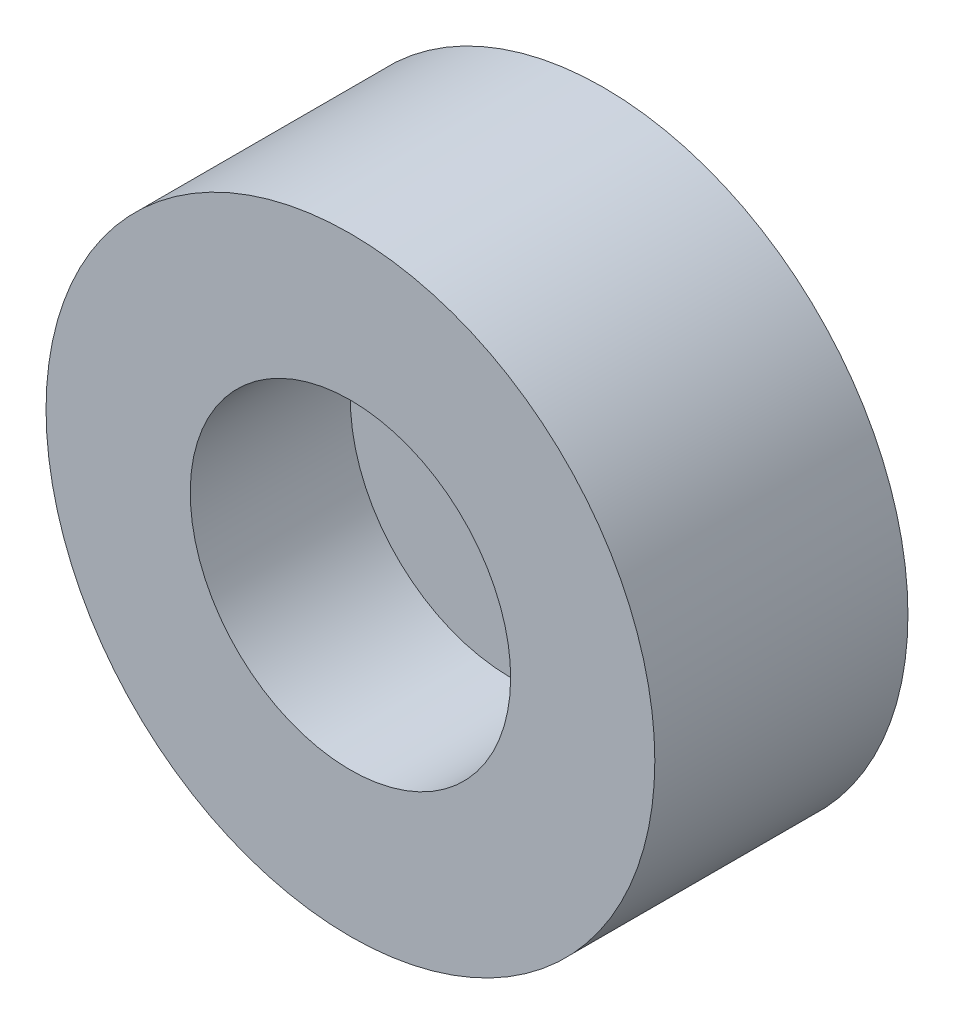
from build123d import *

# Parameters (mm, degrees)
ESQUISSE1_R        = 9.5
ESQUISSE1_R_2      = 5
BOSS_EXTRU_1_DEPTH = 7.9
ESQUISSE2_R        = 5
BOSS_EXTRU_2_DEPTH = 2.9


with BuildPart() as part:
    # Esquisse1 → Boss.-Extru.1 (new body)
    with BuildSketch(Plane.XY):
        with Locations(Location((0, 11, 0), (0, 0, 90))):
            Circle(ESQUISSE1_R)
        with Locations(Location((0, 11, 0), (0, 0, 90))):
            Circle(ESQUISSE1_R_2, mode=Mode.SUBTRACT)
    extrude(amount=BOSS_EXTRU_1_DEPTH)

    # Esquisse2 → Boss.-Extru.2 (add)
    with BuildSketch(Plane(origin=(0, 0, 0), x_dir=(-1, 0, 0), z_dir=(0, 0, -1))):
        with Locations(Location((0, 11, 0), (0, 0, 356.409017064))):
            Circle(ESQUISSE2_R)
    extrude(amount=-BOSS_EXTRU_2_DEPTH)


solid = part.part
